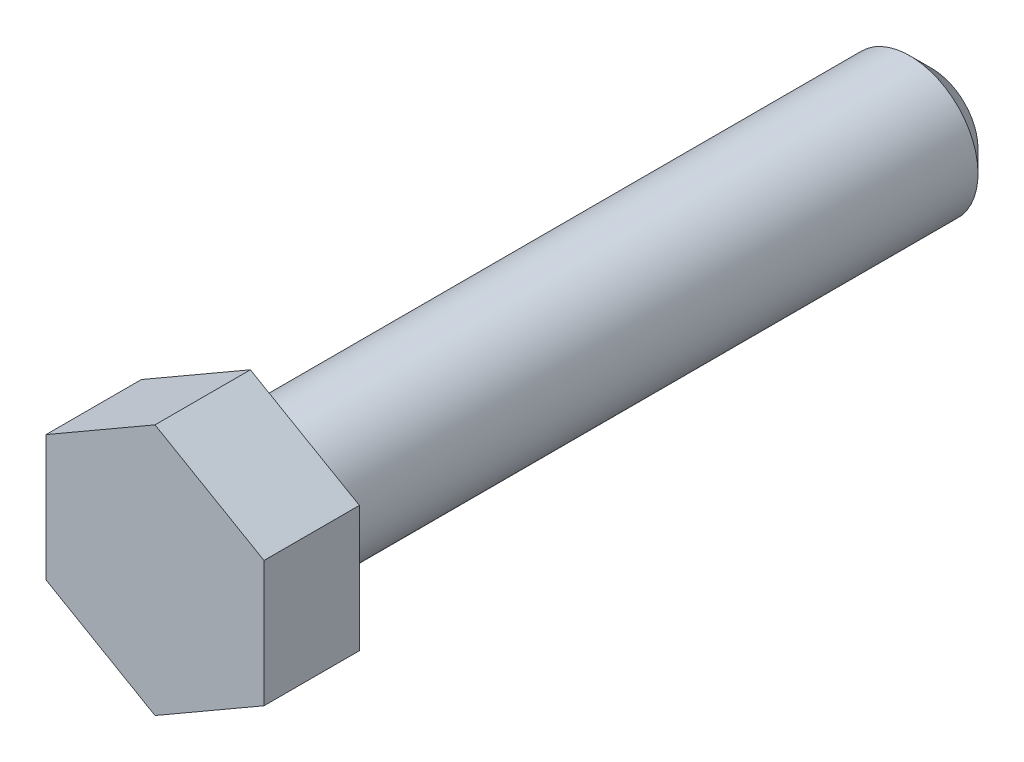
ISO-10303-21;
HEADER;
FILE_DESCRIPTION(('STEP AP214'),'2;1');
FILE_NAME('part.step','',(''),(''),'','','');
FILE_SCHEMA(('AUTOMOTIVE_DESIGN { 1 0 10303 214 1 1 1 1 }'));
ENDSEC;
DATA;
#1=APPLICATION_CONTEXT('core data for automotive mechanical design processes');
#2=APPLICATION_PROTOCOL_DEFINITION('international standard','automotive_design',2000,#1);
#3=PRODUCT_CONTEXT('',#1,'mechanical');
#4=PRODUCT('Part','Part','',(#3));
#5=PRODUCT_RELATED_PRODUCT_CATEGORY('part','',(#4));
#6=PRODUCT_DEFINITION_FORMATION('','',#4);
#7=PRODUCT_DEFINITION_CONTEXT('part definition',#1,'design');
#8=PRODUCT_DEFINITION('design','',#6,#7);
#9=PRODUCT_DEFINITION_SHAPE('','',#8);
#10=(LENGTH_UNIT() NAMED_UNIT(*) SI_UNIT(.MILLI.,.METRE.));
#11=(NAMED_UNIT(*) PLANE_ANGLE_UNIT() SI_UNIT($,.RADIAN.));
#12=(NAMED_UNIT(*) SI_UNIT($,.STERADIAN.) SOLID_ANGLE_UNIT());
#13=UNCERTAINTY_MEASURE_WITH_UNIT(LENGTH_MEASURE(1.E-05),#10,'distance_accuracy_value','');
#14=(GEOMETRIC_REPRESENTATION_CONTEXT(3) GLOBAL_UNCERTAINTY_ASSIGNED_CONTEXT((#13)) GLOBAL_UNIT_ASSIGNED_CONTEXT((#10,
#11,#12)) REPRESENTATION_CONTEXT('',''));
#15=CARTESIAN_POINT('',(0.,0.,0.));
#16=DIRECTION('',(0.,0.,1.));
#17=DIRECTION('',(1.,0.,0.));
#18=AXIS2_PLACEMENT_3D('',#15,#16,#17);
#19=CARTESIAN_POINT('',(0.,4.61880215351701,0.));
#20=DIRECTION('',(0.,0.,1.));
#21=DIRECTION('',(0.,-1.,0.));
#22=AXIS2_PLACEMENT_3D('',#19,#20,#21);
#23=PLANE('',#22);
#24=DIRECTION('',(-0.86602540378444,0.5,0.));
#25=VECTOR('',#24,1.);
#26=CARTESIAN_POINT('',(4.,2.3094010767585,0.));
#27=LINE('',#26,#25);
#28=CARTESIAN_POINT('',(4.,2.3094010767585,0.));
#29=VERTEX_POINT('',#28);
#30=CARTESIAN_POINT('',(0.,4.61880215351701,0.));
#31=VERTEX_POINT('',#30);
#32=EDGE_CURVE('E100',#29,#31,#27,.T.);
#33=ORIENTED_EDGE('',*,*,#32,.F.);
#34=DIRECTION('',(0.,1.,0.));
#35=VECTOR('',#34,1.);
#36=CARTESIAN_POINT('',(4.,-2.30940107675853,0.));
#37=LINE('',#36,#35);
#38=CARTESIAN_POINT('',(4.,-2.30940107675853,0.));
#39=VERTEX_POINT('',#38);
#40=EDGE_CURVE('E60',#39,#29,#37,.T.);
#41=ORIENTED_EDGE('',*,*,#40,.F.);
#42=DIRECTION('',(0.86602540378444,0.5,0.));
#43=VECTOR('',#42,1.);
#44=CARTESIAN_POINT('',(0.,-4.61880215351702,0.));
#45=LINE('',#44,#43);
#46=CARTESIAN_POINT('',(0.,-4.61880215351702,0.));
#47=VERTEX_POINT('',#46);
#48=EDGE_CURVE('E54',#47,#39,#45,.T.);
#49=ORIENTED_EDGE('',*,*,#48,.F.);
#50=DIRECTION('',(0.86602540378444,-0.5,0.));
#51=VECTOR('',#50,1.);
#52=CARTESIAN_POINT('',(-4.,-2.30940107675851,0.));
#53=LINE('',#52,#51);
#54=CARTESIAN_POINT('',(-4.,-2.30940107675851,0.));
#55=VERTEX_POINT('',#54);
#56=EDGE_CURVE('E90',#55,#47,#53,.T.);
#57=ORIENTED_EDGE('',*,*,#56,.F.);
#58=DIRECTION('',(0.,-1.,0.));
#59=VECTOR('',#58,1.);
#60=CARTESIAN_POINT('',(-4.,2.3094010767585,0.));
#61=LINE('',#60,#59);
#62=CARTESIAN_POINT('',(-4.,2.3094010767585,0.));
#63=VERTEX_POINT('',#62);
#64=EDGE_CURVE('E105',#63,#55,#61,.T.);
#65=ORIENTED_EDGE('',*,*,#64,.F.);
#66=DIRECTION('',(-0.866025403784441,-0.5,0.));
#67=VECTOR('',#66,1.);
#68=CARTESIAN_POINT('',(0.,4.61880215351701,0.));
#69=LINE('',#68,#67);
#70=EDGE_CURVE('E103',#31,#63,#69,.T.);
#71=ORIENTED_EDGE('',*,*,#70,.F.);
#72=EDGE_LOOP('',(#33,#41,#49,#57,#65,#71));
#73=FACE_BOUND('',#72,.T.);
#74=CARTESIAN_POINT('',(0.,0.,0.));
#75=DIRECTION('',(0.,0.,1.));
#76=DIRECTION('',(0.,-1.,0.));
#77=AXIS2_PLACEMENT_3D('',#74,#75,#76);
#78=CIRCLE('',#77,2.5);
#79=CARTESIAN_POINT('',(0.,-2.50000000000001,0.));
#80=VERTEX_POINT('',#79);
#81=EDGE_CURVE('E119',#80,#80,#78,.F.);
#82=ORIENTED_EDGE('',*,*,#81,.F.);
#83=EDGE_LOOP('',(#82));
#84=FACE_BOUND('',#83,.T.);
#85=ADVANCED_FACE('F14',(#73,#84),#23,.F.);
#86=CARTESIAN_POINT('',(4.,2.3094010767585,3.5));
#87=DIRECTION('',(-0.5,-0.86602540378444,0.));
#88=DIRECTION('',(0.86602540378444,-0.5,0.));
#89=AXIS2_PLACEMENT_3D('',#86,#87,#88);
#90=PLANE('',#89);
#91=ORIENTED_EDGE('',*,*,#32,.T.);
#92=DIRECTION('',(0.,0.,-1.));
#93=VECTOR('',#92,1.);
#94=CARTESIAN_POINT('',(0.,4.61880215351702,3.49999999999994));
#95=LINE('',#94,#93);
#96=CARTESIAN_POINT('',(0.,4.61880215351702,3.49999999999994));
#97=VERTEX_POINT('',#96);
#98=EDGE_CURVE('E117',#97,#31,#95,.T.);
#99=ORIENTED_EDGE('',*,*,#98,.F.);
#100=DIRECTION('',(-0.86602540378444,0.5,0.));
#101=VECTOR('',#100,1.);
#102=CARTESIAN_POINT('',(4.,2.3094010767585,3.5));
#103=LINE('',#102,#101);
#104=CARTESIAN_POINT('',(4.,2.3094010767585,3.5));
#105=VERTEX_POINT('',#104);
#106=EDGE_CURVE('E110',#105,#97,#103,.T.);
#107=ORIENTED_EDGE('',*,*,#106,.F.);
#108=DIRECTION('',(0.,0.,-1.));
#109=VECTOR('',#108,1.);
#110=CARTESIAN_POINT('',(4.,2.3094010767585,3.5));
#111=LINE('',#110,#109);
#112=EDGE_CURVE('E96',#105,#29,#111,.T.);
#113=ORIENTED_EDGE('',*,*,#112,.T.);
#114=EDGE_LOOP('',(#91,#99,#107,#113));
#115=FACE_BOUND('',#114,.T.);
#116=ADVANCED_FACE('F138',(#115),#90,.F.);
#117=CARTESIAN_POINT('',(0.,4.61880215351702,3.49999999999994));
#118=DIRECTION('',(0.5,-0.866025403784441,0.));
#119=DIRECTION('',(0.866025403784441,0.5,0.));
#120=AXIS2_PLACEMENT_3D('',#117,#118,#119);
#121=PLANE('',#120);
#122=ORIENTED_EDGE('',*,*,#70,.T.);
#123=DIRECTION('',(0.,0.,-1.));
#124=VECTOR('',#123,1.);
#125=CARTESIAN_POINT('',(-4.,2.30940107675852,3.5));
#126=LINE('',#125,#124);
#127=CARTESIAN_POINT('',(-4.,2.30940107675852,3.5));
#128=VERTEX_POINT('',#127);
#129=EDGE_CURVE('E114',#128,#63,#126,.T.);
#130=ORIENTED_EDGE('',*,*,#129,.F.);
#131=DIRECTION('',(-0.866025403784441,-0.5,0.));
#132=VECTOR('',#131,1.);
#133=CARTESIAN_POINT('',(0.,4.61880215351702,3.49999999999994));
#134=LINE('',#133,#132);
#135=EDGE_CURVE('E69',#97,#128,#134,.T.);
#136=ORIENTED_EDGE('',*,*,#135,.F.);
#137=ORIENTED_EDGE('',*,*,#98,.T.);
#138=EDGE_LOOP('',(#122,#130,#136,#137));
#139=FACE_BOUND('',#138,.T.);
#140=ADVANCED_FACE('F144',(#139),#121,.F.);
#141=CARTESIAN_POINT('',(-4.,2.30940107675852,3.5));
#142=DIRECTION('',(1.,0.,0.));
#143=DIRECTION('',(0.,1.,0.));
#144=AXIS2_PLACEMENT_3D('',#141,#142,#143);
#145=PLANE('',#144);
#146=ORIENTED_EDGE('',*,*,#64,.T.);
#147=DIRECTION('',(0.,0.,-1.));
#148=VECTOR('',#147,1.);
#149=CARTESIAN_POINT('',(-4.,-2.30940107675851,3.49999999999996));
#150=LINE('',#149,#148);
#151=CARTESIAN_POINT('',(-4.,-2.30940107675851,3.49999999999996));
#152=VERTEX_POINT('',#151);
#153=EDGE_CURVE('E91',#152,#55,#150,.T.);
#154=ORIENTED_EDGE('',*,*,#153,.F.);
#155=DIRECTION('',(0.,-1.,0.));
#156=VECTOR('',#155,1.);
#157=CARTESIAN_POINT('',(-4.,2.30940107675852,3.5));
#158=LINE('',#157,#156);
#159=EDGE_CURVE('E82',#128,#152,#158,.T.);
#160=ORIENTED_EDGE('',*,*,#159,.F.);
#161=ORIENTED_EDGE('',*,*,#129,.T.);
#162=EDGE_LOOP('',(#146,#154,#160,#161));
#163=FACE_BOUND('',#162,.T.);
#164=ADVANCED_FACE('F158',(#163),#145,.F.);
#165=CARTESIAN_POINT('',(-4.,-2.30940107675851,3.49999999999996));
#166=DIRECTION('',(0.5,0.86602540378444,0.));
#167=DIRECTION('',(-0.86602540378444,0.5,0.));
#168=AXIS2_PLACEMENT_3D('',#165,#166,#167);
#169=PLANE('',#168);
#170=ORIENTED_EDGE('',*,*,#56,.T.);
#171=DIRECTION('',(0.,0.,-1.));
#172=VECTOR('',#171,1.);
#173=CARTESIAN_POINT('',(0.,-4.61880215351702,3.5));
#174=LINE('',#173,#172);
#175=CARTESIAN_POINT('',(0.,-4.61880215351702,3.5));
#176=VERTEX_POINT('',#175);
#177=EDGE_CURVE('E87',#176,#47,#174,.T.);
#178=ORIENTED_EDGE('',*,*,#177,.F.);
#179=DIRECTION('',(0.86602540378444,-0.5,0.));
#180=VECTOR('',#179,1.);
#181=CARTESIAN_POINT('',(-4.,-2.30940107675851,3.49999999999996));
#182=LINE('',#181,#180);
#183=EDGE_CURVE('E76',#152,#176,#182,.T.);
#184=ORIENTED_EDGE('',*,*,#183,.F.);
#185=ORIENTED_EDGE('',*,*,#153,.T.);
#186=EDGE_LOOP('',(#170,#178,#184,#185));
#187=FACE_BOUND('',#186,.T.);
#188=ADVANCED_FACE('F88',(#187),#169,.F.);
#189=CARTESIAN_POINT('',(0.,-4.61880215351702,3.5));
#190=DIRECTION('',(-0.5,0.866025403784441,0.));
#191=DIRECTION('',(-0.866025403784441,-0.5,0.));
#192=AXIS2_PLACEMENT_3D('',#189,#190,#191);
#193=PLANE('',#192);
#194=ORIENTED_EDGE('',*,*,#48,.T.);
#195=DIRECTION('',(0.,0.,-1.));
#196=VECTOR('',#195,1.);
#197=CARTESIAN_POINT('',(4.,-2.30940107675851,3.49999999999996));
#198=LINE('',#197,#196);
#199=CARTESIAN_POINT('',(4.,-2.30940107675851,3.49999999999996));
#200=VERTEX_POINT('',#199);
#201=EDGE_CURVE('E92',#200,#39,#198,.T.);
#202=ORIENTED_EDGE('',*,*,#201,.F.);
#203=DIRECTION('',(0.86602540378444,0.5,0.));
#204=VECTOR('',#203,1.);
#205=CARTESIAN_POINT('',(0.,-4.61880215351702,3.5));
#206=LINE('',#205,#204);
#207=EDGE_CURVE('E80',#176,#200,#206,.T.);
#208=ORIENTED_EDGE('',*,*,#207,.F.);
#209=ORIENTED_EDGE('',*,*,#177,.T.);
#210=EDGE_LOOP('',(#194,#202,#208,#209));
#211=FACE_BOUND('',#210,.T.);
#212=ADVANCED_FACE('F94',(#211),#193,.F.);
#213=CARTESIAN_POINT('',(4.,-2.30940107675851,3.49999999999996));
#214=DIRECTION('',(-1.,0.,0.));
#215=DIRECTION('',(0.,-1.,0.));
#216=AXIS2_PLACEMENT_3D('',#213,#214,#215);
#217=PLANE('',#216);
#218=ORIENTED_EDGE('',*,*,#40,.T.);
#219=ORIENTED_EDGE('',*,*,#112,.F.);
#220=DIRECTION('',(0.,1.,0.));
#221=VECTOR('',#220,1.);
#222=CARTESIAN_POINT('',(4.,-2.30940107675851,3.49999999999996));
#223=LINE('',#222,#221);
#224=EDGE_CURVE('E31',#200,#105,#223,.T.);
#225=ORIENTED_EDGE('',*,*,#224,.F.);
#226=ORIENTED_EDGE('',*,*,#201,.T.);
#227=EDGE_LOOP('',(#218,#219,#225,#226));
#228=FACE_BOUND('',#227,.T.);
#229=ADVANCED_FACE('F151',(#228),#217,.F.);
#230=CARTESIAN_POINT('',(0.,4.61880215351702,3.49999999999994));
#231=DIRECTION('',(0.,0.,1.));
#232=DIRECTION('',(0.,-1.,0.));
#233=AXIS2_PLACEMENT_3D('',#230,#231,#232);
#234=PLANE('',#233);
#235=ORIENTED_EDGE('',*,*,#106,.T.);
#236=ORIENTED_EDGE('',*,*,#135,.T.);
#237=ORIENTED_EDGE('',*,*,#159,.T.);
#238=ORIENTED_EDGE('',*,*,#183,.T.);
#239=ORIENTED_EDGE('',*,*,#207,.T.);
#240=ORIENTED_EDGE('',*,*,#224,.T.);
#241=EDGE_LOOP('',(#235,#236,#237,#238,#239,#240));
#242=FACE_BOUND('',#241,.T.);
#243=ADVANCED_FACE('F78',(#242),#234,.T.);
#244=CARTESIAN_POINT('',(0.,0.,0.));
#245=DIRECTION('',(0.,0.,1.));
#246=DIRECTION('',(0.,-1.,0.));
#247=AXIS2_PLACEMENT_3D('',#244,#245,#246);
#248=CYLINDRICAL_SURFACE('',#247,2.5);
#249=CARTESIAN_POINT('',(0.,0.,-24.2));
#250=DIRECTION('',(0.,0.,1.));
#251=DIRECTION('',(0.,-1.,0.));
#252=AXIS2_PLACEMENT_3D('',#249,#250,#251);
#253=CIRCLE('',#252,2.5);
#254=CARTESIAN_POINT('',(0.,-2.50000000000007,-24.2));
#255=VERTEX_POINT('',#254);
#256=EDGE_CURVE('E23',#255,#255,#253,.T.);
#257=ORIENTED_EDGE('',*,*,#256,.T.);
#258=EDGE_LOOP('',(#257));
#259=FACE_BOUND('',#258,.T.);
#260=ORIENTED_EDGE('',*,*,#81,.T.);
#261=EDGE_LOOP('',(#260));
#262=FACE_BOUND('',#261,.T.);
#263=ADVANCED_FACE('F124',(#259,#262),#248,.T.);
#264=CARTESIAN_POINT('',(2.5,0.,-25.));
#265=DIRECTION('',(0.,0.,1.));
#266=DIRECTION('',(0.,-1.,0.));
#267=AXIS2_PLACEMENT_3D('',#264,#265,#266);
#268=PLANE('',#267);
#269=CARTESIAN_POINT('',(0.,0.,-25.));
#270=DIRECTION('',(0.,0.,1.));
#271=DIRECTION('',(0.,-1.,0.));
#272=AXIS2_PLACEMENT_3D('',#269,#270,#271);
#273=CIRCLE('',#272,1.7);
#274=CARTESIAN_POINT('',(0.,-1.70000000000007,-25.));
#275=VERTEX_POINT('',#274);
#276=EDGE_CURVE('E9',#275,#275,#273,.F.);
#277=ORIENTED_EDGE('',*,*,#276,.T.);
#278=EDGE_LOOP('',(#277));
#279=FACE_BOUND('',#278,.T.);
#280=ADVANCED_FACE('F128',(#279),#268,.F.);
#281=CARTESIAN_POINT('',(0.,0.,-24.2));
#282=DIRECTION('',(0.,0.,1.));
#283=DIRECTION('',(0.,-1.,0.));
#284=AXIS2_PLACEMENT_3D('',#281,#282,#283);
#285=CONICAL_SURFACE('',#284,2.5,0.78539816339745);
#286=ORIENTED_EDGE('',*,*,#276,.F.);
#287=EDGE_LOOP('',(#286));
#288=FACE_BOUND('',#287,.T.);
#289=ORIENTED_EDGE('',*,*,#256,.F.);
#290=EDGE_LOOP('',(#289));
#291=FACE_BOUND('',#290,.T.);
#292=ADVANCED_FACE('F16',(#288,#291),#285,.T.);
#293=CLOSED_SHELL('',(#85,#116,#140,#164,#188,#212,#229,#243,#263,#280,#292));
#294=MANIFOLD_SOLID_BREP('B1',#293);
#295=ADVANCED_BREP_SHAPE_REPRESENTATION('',(#18,#294),#14);
#296=SHAPE_DEFINITION_REPRESENTATION(#9,#295);
ENDSEC;
END-ISO-10303-21;
